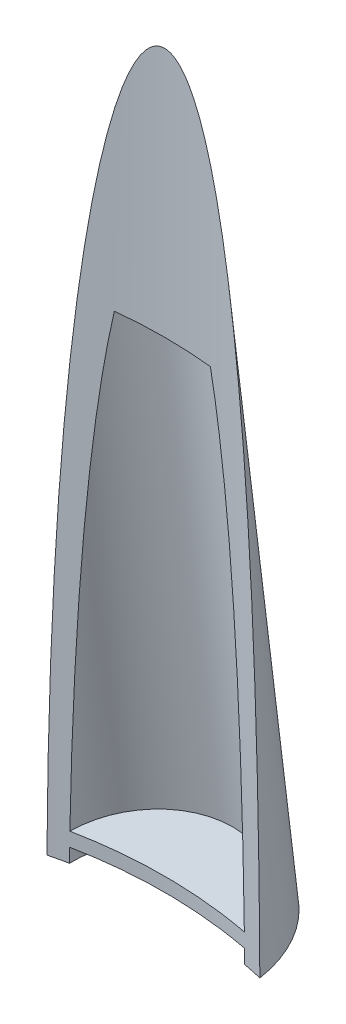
ISO-10303-21;
HEADER;
FILE_DESCRIPTION(('STEP AP214'),'2;1');
FILE_NAME('part.step','',(''),(''),'','','');
FILE_SCHEMA(('AUTOMOTIVE_DESIGN { 1 0 10303 214 1 1 1 1 }'));
ENDSEC;
DATA;
#1=APPLICATION_CONTEXT('core data for automotive mechanical design processes');
#2=APPLICATION_PROTOCOL_DEFINITION('international standard','automotive_design',2000,#1);
#3=PRODUCT_CONTEXT('',#1,'mechanical');
#4=PRODUCT('Part','Part','',(#3));
#5=PRODUCT_RELATED_PRODUCT_CATEGORY('part','',(#4));
#6=PRODUCT_DEFINITION_FORMATION('','',#4);
#7=PRODUCT_DEFINITION_CONTEXT('part definition',#1,'design');
#8=PRODUCT_DEFINITION('design','',#6,#7);
#9=PRODUCT_DEFINITION_SHAPE('','',#8);
#10=(LENGTH_UNIT() NAMED_UNIT(*) SI_UNIT(.MILLI.,.METRE.));
#11=(NAMED_UNIT(*) PLANE_ANGLE_UNIT() SI_UNIT($,.RADIAN.));
#12=(NAMED_UNIT(*) SI_UNIT($,.STERADIAN.) SOLID_ANGLE_UNIT());
#13=UNCERTAINTY_MEASURE_WITH_UNIT(LENGTH_MEASURE(1.E-05),#10,'distance_accuracy_value','');
#14=(GEOMETRIC_REPRESENTATION_CONTEXT(3) GLOBAL_UNCERTAINTY_ASSIGNED_CONTEXT((#13)) GLOBAL_UNIT_ASSIGNED_CONTEXT((#10,
#11,#12)) REPRESENTATION_CONTEXT('',''));
#15=CARTESIAN_POINT('',(0.,0.,0.));
#16=DIRECTION('',(0.,0.,1.));
#17=DIRECTION('',(1.,0.,0.));
#18=AXIS2_PLACEMENT_3D('',#15,#16,#17);
#19=CARTESIAN_POINT('',(0.,-8.82373528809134,24.3165815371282));
#20=DIRECTION('',(0.,-0.992546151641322,-0.121869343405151));
#21=DIRECTION('',(1.,0.,0.));
#22=AXIS2_PLACEMENT_3D('',#19,#20,#21);
#23=CYLINDRICAL_SURFACE('',#22,12.065);
#24=CARTESIAN_POINT('',(0.,-8.82373528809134,24.3165815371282));
#25=DIRECTION('',(0.,-0.992546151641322,-0.121869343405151));
#26=DIRECTION('',(1.,0.,0.));
#27=AXIS2_PLACEMENT_3D('',#24,#25,#26);
#28=CIRCLE('',#27,12.065);
#29=CARTESIAN_POINT('',(-6.58255705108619,-7.59150322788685,14.2808567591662));
#30=VERTEX_POINT('',#29);
#31=CARTESIAN_POINT('',(6.58255705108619,-7.59150322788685,14.2808567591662));
#32=VERTEX_POINT('',#31);
#33=EDGE_CURVE('E92',#30,#32,#28,.T.);
#34=ORIENTED_EDGE('',*,*,#33,.F.);
#35=CARTESIAN_POINT('',(-6.58255705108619,-7.59150322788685,14.2808567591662));
#36=CARTESIAN_POINT('',(-6.6904230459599,-8.08472638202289,14.291070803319));
#37=CARTESIAN_POINT('',(-6.79457407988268,-8.57875136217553,14.3011795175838));
#38=CARTESIAN_POINT('',(-6.99621983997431,-9.56814261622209,14.321181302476));
#39=CARTESIAN_POINT('',(-7.09371484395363,-10.0635088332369,14.3310743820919));
#40=CARTESIAN_POINT('',(-7.28281468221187,-11.0552756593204,14.3506390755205));
#41=CARTESIAN_POINT('',(-7.37442053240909,-11.5516760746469,14.3603107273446));
#42=CARTESIAN_POINT('',(-7.55234989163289,-12.5454304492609,14.3794318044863));
#43=CARTESIAN_POINT('',(-7.6386733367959,-13.0427844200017,14.3888812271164));
#44=CARTESIAN_POINT('',(-7.89040001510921,-14.5354978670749,14.4168827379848));
#45=CARTESIAN_POINT('',(-8.04866552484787,-15.5320711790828,14.4350991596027));
#46=CARTESIAN_POINT('',(-8.34927250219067,-17.5276628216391,14.4706309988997));
#47=CARTESIAN_POINT('',(-8.49161312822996,-18.5266812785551,14.4879463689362));
#48=CARTESIAN_POINT('',(-8.7624670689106,-20.5254423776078,14.5216575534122));
#49=CARTESIAN_POINT('',(-8.89099592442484,-21.5251829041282,14.5380543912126));
#50=CARTESIAN_POINT('',(-9.13613743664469,-23.5261116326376,14.5699548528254));
#51=CARTESIAN_POINT('',(-9.25275032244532,-24.5272998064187,14.5854584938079));
#52=CARTESIAN_POINT('',(-9.47543615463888,-26.5310395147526,14.6155837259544));
#53=CARTESIAN_POINT('',(-9.58150720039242,-27.5335912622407,14.6302051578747));
#54=CARTESIAN_POINT('',(-9.78416755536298,-29.5396681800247,14.6585727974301));
#55=CARTESIAN_POINT('',(-9.88075679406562,-30.5431933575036,14.672318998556));
#56=CARTESIAN_POINT('',(-10.1178656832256,-33.122266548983,14.7065224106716));
#57=CARTESIAN_POINT('',(-10.2521108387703,-34.6984012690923,14.7263478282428));
#58=CARTESIAN_POINT('',(-10.502172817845,-37.8521551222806,14.7639156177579));
#59=CARTESIAN_POINT('',(-10.6179894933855,-39.4297742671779,14.7816579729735));
#60=CARTESIAN_POINT('',(-10.83323550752,-42.5860912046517,14.8151062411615));
#61=CARTESIAN_POINT('',(-10.9326654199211,-44.1647889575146,14.8308122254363));
#62=CARTESIAN_POINT('',(-11.1167520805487,-47.3230541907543,14.8602363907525));
#63=CARTESIAN_POINT('',(-11.2014088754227,-48.902621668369,14.8739545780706));
#64=CARTESIAN_POINT('',(-11.3572650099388,-52.0631427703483,14.8994568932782));
#65=CARTESIAN_POINT('',(-11.4284582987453,-53.6440966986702,14.9112401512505));
#66=CARTESIAN_POINT('',(-11.5583751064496,-56.8065300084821,14.9329127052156));
#67=CARTESIAN_POINT('',(-11.6170986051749,-58.3880093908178,14.9428019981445));
#68=CARTESIAN_POINT('',(-11.7229155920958,-61.5513365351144,14.9607331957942));
#69=CARTESIAN_POINT('',(-11.7700092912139,-63.1331842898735,14.9687751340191));
#70=CARTESIAN_POINT('',(-11.8532549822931,-66.2971747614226,14.9830576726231));
#71=CARTESIAN_POINT('',(-11.8894069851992,-67.879317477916,14.989298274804));
#72=CARTESIAN_POINT('',(-11.9275265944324,-69.8274527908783,14.9959005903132));
#73=CARTESIAN_POINT('',(-11.9344084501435,-70.1933504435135,14.9970936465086));
#74=CARTESIAN_POINT('',(-11.9476218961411,-70.9251190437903,14.999386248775));
#75=CARTESIAN_POINT('',(-11.9539535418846,-71.2909899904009,15.0004858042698));
#76=CARTESIAN_POINT('',(-11.9600132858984,-71.6568657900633,15.0015389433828));
#77=B_SPLINE_CURVE_WITH_KNOTS('',3,(#35,#36,#37,#38,#39,#40,#41,#42,#43,#44,#45,#46,#47,#48,#49,
#50,#51,#52,#53,#54,#55,#56,#57,#58,#59,#60,#61,#62,#63,#64,#65,#66,#67,#68,#69,#70,#71,#72,#73,
#74,#75,#76),.UNSPECIFIED.,.F.,.F.,(4,2,2,2,2,2,2,2,2,2,2,2,2,2,2,2,2,2,2,2,4),(0.,
1.51491834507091,3.02977342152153,4.54436647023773,6.05897782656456,9.08648394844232,
12.1141499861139,15.1383728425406,18.162537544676,21.1872465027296,24.2119779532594,
28.9577390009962,33.7035381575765,38.4491710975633,43.1947890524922,47.9425347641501,
52.6902881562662,57.4379554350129,62.1856179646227,63.2835106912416,64.3812926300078),.UNSPECIFIED.);
#78=CARTESIAN_POINT('',(-11.9600132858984,-71.6568657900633,15.0015389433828));
#79=VERTEX_POINT('',#78);
#80=EDGE_CURVE('E83',#30,#79,#77,.T.);
#81=ORIENTED_EDGE('',*,*,#80,.T.);
#82=CARTESIAN_POINT('',(0.,-71.8504159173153,16.5778782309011));
#83=DIRECTION('',(0.,-0.992546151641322,-0.121869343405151));
#84=DIRECTION('',(1.,0.,0.));
#85=AXIS2_PLACEMENT_3D('',#82,#83,#84);
#86=CIRCLE('',#85,12.065);
#87=CARTESIAN_POINT('',(11.9600132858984,-71.6568657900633,15.0015389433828));
#88=VERTEX_POINT('',#87);
#89=EDGE_CURVE('E90',#79,#88,#86,.T.);
#90=ORIENTED_EDGE('',*,*,#89,.T.);
#91=CARTESIAN_POINT('',(11.9600132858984,-71.6568657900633,15.0015389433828));
#92=CARTESIAN_POINT('',(11.9433466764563,-70.6507158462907,14.9986428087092));
#93=CARTESIAN_POINT('',(11.9246292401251,-69.6446016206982,14.9953957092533));
#94=CARTESIAN_POINT('',(11.8829554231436,-67.6324623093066,14.988188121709));
#95=CARTESIAN_POINT('',(11.8599990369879,-66.6264372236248,14.984227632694));
#96=CARTESIAN_POINT('',(11.7845712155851,-63.6087512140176,14.9712598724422));
#97=CARTESIAN_POINT('',(11.7255374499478,-61.5972544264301,14.9611656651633));
#98=CARTESIAN_POINT('',(11.5886656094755,-57.5772893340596,14.9379982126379));
#99=CARTESIAN_POINT('',(11.510849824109,-55.5688202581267,14.9249284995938));
#100=CARTESIAN_POINT('',(11.3786290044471,-52.5567038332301,14.9030117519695));
#101=CARTESIAN_POINT('',(11.3319693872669,-51.5527047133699,14.8953202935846));
#102=CARTESIAN_POINT('',(11.2332017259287,-49.5449741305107,14.8791544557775));
#103=CARTESIAN_POINT('',(11.1810936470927,-48.5412426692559,14.8706800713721));
#104=CARTESIAN_POINT('',(11.0344729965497,-45.865212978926,14.8470229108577));
#105=CARTESIAN_POINT('',(10.9348454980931,-44.1931973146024,14.8311335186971));
#106=CARTESIAN_POINT('',(10.7178543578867,-40.8503481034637,14.7970894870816));
#107=CARTESIAN_POINT('',(10.6004908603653,-39.1795145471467,14.7789348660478));
#108=CARTESIAN_POINT('',(10.3457902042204,-35.8398282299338,14.7403088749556));
#109=CARTESIAN_POINT('',(10.2084582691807,-34.1709750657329,14.7198381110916));
#110=CARTESIAN_POINT('',(9.91082543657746,-30.8352478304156,14.6765203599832));
#111=CARTESIAN_POINT('',(9.7505235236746,-29.1683738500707,14.6536732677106));
#112=CARTESIAN_POINT('',(9.48958993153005,-26.6684658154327,14.617559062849));
#113=CARTESIAN_POINT('',(9.39909289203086,-25.8343555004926,14.6051997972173));
#114=CARTESIAN_POINT('',(9.21062329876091,-24.1669882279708,14.5798672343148));
#115=CARTESIAN_POINT('',(9.11265076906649,-23.3337312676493,14.5668939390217));
#116=CARTESIAN_POINT('',(8.9084496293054,-21.6683405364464,14.5403303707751));
#117=CARTESIAN_POINT('',(8.80222203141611,-20.836206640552,14.5267401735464));
#118=CARTESIAN_POINT('',(8.58052059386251,-19.1731665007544,14.4989378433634));
#119=CARTESIAN_POINT('',(8.46504663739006,-18.3422602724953,14.4847257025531));
#120=CARTESIAN_POINT('',(8.22351900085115,-16.6811871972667,14.4556644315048));
#121=CARTESIAN_POINT('',(8.09745537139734,-15.8510218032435,14.4408147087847));
#122=CARTESIAN_POINT('',(7.83329389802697,-14.1926356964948,14.4104925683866));
#123=CARTESIAN_POINT('',(7.69519649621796,-13.3644149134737,14.3950201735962));
#124=CARTESIAN_POINT('',(7.47744619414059,-12.123780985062,14.3713455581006));
#125=CARTESIAN_POINT('',(7.40307869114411,-11.7104327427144,14.3633746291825));
#126=CARTESIAN_POINT('',(7.25048530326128,-10.8844536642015,14.347279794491));
#127=CARTESIAN_POINT('',(7.17225944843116,-10.4718228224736,14.3391558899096));
#128=CARTESIAN_POINT('',(7.01156920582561,-9.64733626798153,14.3227558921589));
#129=CARTESIAN_POINT('',(6.92910430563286,-9.2354806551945,14.3144797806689));
#130=CARTESIAN_POINT('',(6.75947339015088,-8.41273104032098,14.2977789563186));
#131=CARTESIAN_POINT('',(6.67230724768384,-8.00183706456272,14.2893542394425));
#132=CARTESIAN_POINT('',(6.58255705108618,-7.59150322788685,14.2808567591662));
#133=B_SPLINE_CURVE_WITH_KNOTS('',3,(#91,#92,#93,#94,#95,#96,#97,#98,#99,#100,#101,#102,#103,
#104,#105,#106,#107,#108,#109,#110,#111,#112,#113,#114,#115,#116,#117,#118,#119,#120,#121,#122,
#123,#124,#125,#126,#127,#128,#129,#130,#131,#132),.UNSPECIFIED.,.F.,.F.,(4,2,2,2,2,2,2,2,2,2,2,
2,2,2,2,2,2,2,2,2,4),(0.,3.01887246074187,6.03774884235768,12.0748262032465,18.104774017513,
21.1200974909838,24.1354401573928,29.1605198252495,34.1855586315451,39.2092852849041,
44.2332340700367,46.7504953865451,49.2677485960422,51.7846936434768,54.3016704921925,
56.8210391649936,59.3403153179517,60.6004818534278,61.8606385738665,63.1209479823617,
64.3812915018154),.UNSPECIFIED.);
#134=EDGE_CURVE('E61',#88,#32,#133,.T.);
#135=ORIENTED_EDGE('',*,*,#134,.T.);
#136=EDGE_LOOP('',(#34,#81,#90,#135));
#137=FACE_BOUND('',#136,.T.);
#138=ADVANCED_FACE('F37',(#137),#23,.F.);
#139=CARTESIAN_POINT('',(0.,-8.82373528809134,24.3165815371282));
#140=DIRECTION('',(0.,-0.992546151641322,-0.121869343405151));
#141=DIRECTION('',(1.,0.,0.));
#142=AXIS2_PLACEMENT_3D('',#139,#140,#141);
#143=PLANE('',#142);
#144=CARTESIAN_POINT('',(0.,-16.1298363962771,83.82));
#145=DIRECTION('',(0.,-0.992546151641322,-0.121869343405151));
#146=DIRECTION('',(0.,-0.121869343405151,0.992546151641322));
#147=AXIS2_PLACEMENT_3D('',#144,#145,#146);
#148=ELLIPSE('',#147,70.3745613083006,69.85);
#149=EDGE_CURVE('E93',#30,#32,#148,.T.);
#150=ORIENTED_EDGE('',*,*,#149,.F.);
#151=ORIENTED_EDGE('',*,*,#33,.T.);
#152=EDGE_LOOP('',(#150,#151));
#153=FACE_BOUND('',#152,.T.);
#154=ADVANCED_FACE('F160',(#153),#143,.T.);
#155=CARTESIAN_POINT('',(0.,-71.8504159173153,16.5778782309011));
#156=DIRECTION('',(0.,-0.992546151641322,-0.121869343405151));
#157=DIRECTION('',(1.,0.,0.));
#158=AXIS2_PLACEMENT_3D('',#155,#156,#157);
#159=PLANE('',#158);
#160=ORIENTED_EDGE('',*,*,#89,.F.);
#161=CARTESIAN_POINT('',(0.,-80.106710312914,83.82));
#162=DIRECTION('',(0.,-0.992546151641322,-0.121869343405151));
#163=DIRECTION('',(0.,-0.121869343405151,0.992546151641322));
#164=AXIS2_PLACEMENT_3D('',#161,#162,#163);
#165=ELLIPSE('',#164,70.3745613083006,69.85);
#166=EDGE_CURVE('E11',#79,#88,#165,.T.);
#167=ORIENTED_EDGE('',*,*,#166,.T.);
#168=EDGE_LOOP('',(#160,#167));
#169=FACE_BOUND('',#168,.T.);
#170=ADVANCED_FACE('F95',(#169),#159,.F.);
#171=CARTESIAN_POINT('',(0.,26.9905740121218,83.82));
#172=DIRECTION('',(0.,-1.,0.));
#173=DIRECTION('',(0.,0.,-1.));
#174=AXIS2_PLACEMENT_3D('',#171,#172,#173);
#175=CYLINDRICAL_SURFACE('',#174,69.85);
#176=ORIENTED_EDGE('',*,*,#149,.T.);
#177=ORIENTED_EDGE('',*,*,#134,.F.);
#178=ORIENTED_EDGE('',*,*,#166,.F.);
#179=ORIENTED_EDGE('',*,*,#80,.F.);
#180=EDGE_LOOP('',(#176,#177,#178,#179));
#181=FACE_BOUND('',#180,.T.);
#182=CARTESIAN_POINT('',(0.,-83.9453227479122,83.82));
#183=DIRECTION('',(0.,-0.992546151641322,-0.121869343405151));
#184=DIRECTION('',(0.,-0.121869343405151,0.992546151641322));
#185=AXIS2_PLACEMENT_3D('',#182,#183,#184);
#186=ELLIPSE('',#185,70.3745613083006,69.85);
#187=CARTESIAN_POINT('',(-14.5923880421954,-75.5580634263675,15.5112545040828));
#188=VERTEX_POINT('',#187);
#189=CARTESIAN_POINT('',(-12.0137438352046,-75.4966274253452,15.0108984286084));
#190=VERTEX_POINT('',#189);
#191=EDGE_CURVE('E112',#188,#190,#186,.T.);
#192=ORIENTED_EDGE('',*,*,#191,.T.);
#193=CARTESIAN_POINT('',(-11.9893313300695,-73.5767984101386,15.0066405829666));
#194=CARTESIAN_POINT('',(-11.9938052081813,-73.8967646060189,15.007420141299));
#195=CARTESIAN_POINT('',(-11.9980765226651,-74.2167334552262,15.0081647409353));
#196=CARTESIAN_POINT('',(-12.0062140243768,-74.8566764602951,15.0095840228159));
#197=CARTESIAN_POINT('',(-12.0100802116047,-75.1766506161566,15.0102587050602));
#198=CARTESIAN_POINT('',(-12.0137438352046,-75.4966274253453,15.0108984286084));
#199=B_SPLINE_CURVE_WITH_KNOTS('',3,(#193,#194,#195,#196,#197,#198),.UNSPECIFIED.,.F.,.F.,(4,2,
4),(0.,0.959994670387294,1.91998934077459),.UNSPECIFIED.);
#200=CARTESIAN_POINT('',(-11.9893313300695,-73.5767984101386,15.0066405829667));
#201=VERTEX_POINT('',#200);
#202=EDGE_CURVE('E53',#201,#190,#199,.T.);
#203=ORIENTED_EDGE('',*,*,#202,.F.);
#204=CARTESIAN_POINT('',(0.,-82.0260165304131,83.82));
#205=DIRECTION('',(0.,-0.992546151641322,-0.121869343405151));
#206=DIRECTION('',(0.,-0.121869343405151,0.992546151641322));
#207=AXIS2_PLACEMENT_3D('',#204,#205,#206);
#208=ELLIPSE('',#207,70.3745613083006,69.85);
#209=CARTESIAN_POINT('',(11.9893313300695,-73.5767984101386,15.0066405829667));
#210=VERTEX_POINT('',#209);
#211=EDGE_CURVE('E221',#201,#210,#208,.T.);
#212=ORIENTED_EDGE('',*,*,#211,.T.);
#213=CARTESIAN_POINT('',(12.0137438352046,-75.4966274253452,15.0108984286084));
#214=CARTESIAN_POINT('',(12.0100802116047,-75.1766506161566,15.0102587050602));
#215=CARTESIAN_POINT('',(12.0062140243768,-74.8566764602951,15.0095840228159));
#216=CARTESIAN_POINT('',(11.9980765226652,-74.2167334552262,15.0081647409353));
#217=CARTESIAN_POINT('',(11.9938052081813,-73.8967646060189,15.007420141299));
#218=CARTESIAN_POINT('',(11.9893313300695,-73.5767984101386,15.0066405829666));
#219=B_SPLINE_CURVE_WITH_KNOTS('',3,(#213,#214,#215,#216,#217,#218),.UNSPECIFIED.,.F.,.F.,(4,2,
4),(0.,0.959994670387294,1.91998934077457),.UNSPECIFIED.);
#220=CARTESIAN_POINT('',(12.0137438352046,-75.4966274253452,15.0108984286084));
#221=VERTEX_POINT('',#220);
#222=EDGE_CURVE('E145',#221,#210,#219,.T.);
#223=ORIENTED_EDGE('',*,*,#222,.F.);
#224=CARTESIAN_POINT('',(14.5923880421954,-75.5580634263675,15.5112545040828));
#225=VERTEX_POINT('',#224);
#226=EDGE_CURVE('E110',#221,#225,#186,.T.);
#227=ORIENTED_EDGE('',*,*,#226,.T.);
#228=CARTESIAN_POINT('',(-14.5923880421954,-75.5580634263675,15.5112545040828));
#229=CARTESIAN_POINT('',(-14.5861693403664,-74.3422467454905,15.5099264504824));
#230=CARTESIAN_POINT('',(-14.5776339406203,-73.1264435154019,15.5081034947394));
#231=CARTESIAN_POINT('',(-14.5558014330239,-70.6948803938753,15.5034479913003));
#232=CARTESIAN_POINT('',(-14.5425043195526,-69.4791205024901,15.5006154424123));
#233=CARTESIAN_POINT('',(-14.4952760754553,-65.831788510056,15.4905733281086));
#234=CARTESIAN_POINT('',(-14.4540087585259,-63.4003103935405,15.4818194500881));
#235=CARTESIAN_POINT('',(-14.3504748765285,-58.5320364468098,15.4600030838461));
#236=CARTESIAN_POINT('',(-14.2881586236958,-56.0952417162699,15.446930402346));
#237=CARTESIAN_POINT('',(-14.1408380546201,-51.2224761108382,15.4163093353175));
#238=CARTESIAN_POINT('',(-14.0558348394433,-48.7865052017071,15.3987611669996));
#239=CARTESIAN_POINT('',(-13.8736356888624,-44.2334382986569,15.3616024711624));
#240=CARTESIAN_POINT('',(-13.7794787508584,-42.1162163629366,15.3425599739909));
#241=CARTESIAN_POINT('',(-13.5704642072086,-37.8828077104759,15.3008319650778));
#242=CARTESIAN_POINT('',(-13.4556064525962,-35.766621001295,15.2781464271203));
#243=CARTESIAN_POINT('',(-13.2027989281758,-31.5350901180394,15.2290003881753));
#244=CARTESIAN_POINT('',(-13.0648429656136,-29.4197463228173,15.2025388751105));
#245=CARTESIAN_POINT('',(-12.7628062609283,-25.1909951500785,15.1457187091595));
#246=CARTESIAN_POINT('',(-12.5987258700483,-23.0775877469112,15.1153601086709));
#247=CARTESIAN_POINT('',(-12.2406122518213,-18.8555549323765,15.0506522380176));
#248=CARTESIAN_POINT('',(-12.0466104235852,-16.7469268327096,15.0163071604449));
#249=CARTESIAN_POINT('',(-11.7288783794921,-13.5866683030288,14.961686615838));
#250=CARTESIAN_POINT('',(-11.6185086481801,-12.53366065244,14.9429619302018));
#251=CARTESIAN_POINT('',(-11.3879400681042,-10.4287385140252,14.9044645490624));
#252=CARTESIAN_POINT('',(-11.2677412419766,-9.37682402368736,14.8846918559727));
#253=CARTESIAN_POINT('',(-11.0165015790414,-7.27482605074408,14.844095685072));
#254=CARTESIAN_POINT('',(-10.8854660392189,-6.22474192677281,14.8232727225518));
#255=CARTESIAN_POINT('',(-10.6111758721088,-4.1261939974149,14.7805567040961));
#256=CARTESIAN_POINT('',(-10.4679213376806,-3.07773017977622,14.7586636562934));
#257=CARTESIAN_POINT('',(-10.1675464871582,-0.982923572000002,14.7138022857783));
#258=CARTESIAN_POINT('',(-10.0104276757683,0.0634194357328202,14.6908340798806));
#259=CARTESIAN_POINT('',(-9.68019654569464,2.15354129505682,14.643817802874));
#260=CARTESIAN_POINT('',(-9.50708473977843,3.19732022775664,14.6197697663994));
#261=CARTESIAN_POINT('',(-9.23321310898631,4.76096487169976,14.5828804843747));
#262=CARTESIAN_POINT('',(-9.13950917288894,5.28208013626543,14.5704419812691));
#263=CARTESIAN_POINT('',(-8.94692931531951,6.32335003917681,14.5452975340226));
#264=CARTESIAN_POINT('',(-8.84805339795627,6.84350467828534,14.5325915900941));
#265=CARTESIAN_POINT('',(-8.64459431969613,7.88276873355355,14.5069131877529));
#266=CARTESIAN_POINT('',(-8.54001034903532,8.40187799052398,14.4939406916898));
#267=CARTESIAN_POINT('',(-8.32452036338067,9.4387778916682,14.4677351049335));
#268=CARTESIAN_POINT('',(-8.21361436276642,9.9565685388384,14.454502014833));
#269=CARTESIAN_POINT('',(-7.98478924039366,10.9902678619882,14.4277892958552));
#270=CARTESIAN_POINT('',(-7.86687438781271,11.5061774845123,14.4143098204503));
#271=CARTESIAN_POINT('',(-7.62303783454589,12.5360930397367,14.3871054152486));
#272=CARTESIAN_POINT('',(-7.4971162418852,13.0500989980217,14.3733804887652));
#273=CARTESIAN_POINT('',(-7.2361210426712,14.0756599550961,14.3457005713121));
#274=CARTESIAN_POINT('',(-7.10104952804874,14.5872154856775,14.3317456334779));
#275=CARTESIAN_POINT('',(-6.82022943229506,15.6073674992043,14.3036213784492));
#276=CARTESIAN_POINT('',(-6.67448136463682,16.1159641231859,14.2894520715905));
#277=CARTESIAN_POINT('',(-6.3700914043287,17.1301286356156,14.2609037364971));
#278=CARTESIAN_POINT('',(-6.2114306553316,17.6356908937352,14.2465244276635));
#279=CARTESIAN_POINT('',(-5.87863893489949,18.6418521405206,14.2176148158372));
#280=CARTESIAN_POINT('',(-5.7045043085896,19.1424499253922,14.2030844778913));
#281=CARTESIAN_POINT('',(-5.33668445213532,20.1373284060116,14.1739191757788));
#282=CARTESIAN_POINT('',(-5.14297197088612,20.631599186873,14.1592840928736));
#283=CARTESIAN_POINT('',(-4.83351934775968,21.3649135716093,14.1373610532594));
#284=CARTESIAN_POINT('',(-4.72724473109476,21.6079543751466,14.1300597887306));
#285=CARTESIAN_POINT('',(-4.50731993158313,22.0906658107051,14.1154897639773));
#286=CARTESIAN_POINT('',(-4.39367051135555,22.3303367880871,14.1082210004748));
#287=CARTESIAN_POINT('',(-4.15698584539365,22.8067359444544,14.0937057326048));
#288=CARTESIAN_POINT('',(-4.03390061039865,23.0434394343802,14.0864595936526));
#289=CARTESIAN_POINT('',(-3.77706194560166,23.5111708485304,14.0720761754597));
#290=CARTESIAN_POINT('',(-3.64330403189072,23.7421963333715,14.0649389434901));
#291=CARTESIAN_POINT('',(-3.36333700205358,24.1952812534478,14.050880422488));
#292=CARTESIAN_POINT('',(-3.21718374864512,24.4173748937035,14.0439583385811));
#293=CARTESIAN_POINT('',(-2.90876124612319,24.8499733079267,14.0304198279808));
#294=CARTESIAN_POINT('',(-2.74650930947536,25.0604901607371,14.0238030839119));
#295=CARTESIAN_POINT('',(-2.44929044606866,25.4078394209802,14.0128444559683));
#296=CARTESIAN_POINT('',(-2.31928754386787,25.5488797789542,14.0083817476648));
#297=CARTESIAN_POINT('',(-2.04602723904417,25.818224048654,13.9998381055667));
#298=CARTESIAN_POINT('',(-1.90274807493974,25.9465063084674,13.9957578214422));
#299=CARTESIAN_POINT('',(-1.59905285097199,26.1855531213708,13.9881381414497));
#300=CARTESIAN_POINT('',(-1.43844859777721,26.2960841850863,13.9846059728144));
#301=CARTESIAN_POINT('',(-1.10056936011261,26.487816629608,13.978468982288));
#302=CARTESIAN_POINT('',(-0.923357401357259,26.5691236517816,13.975860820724));
#303=CARTESIAN_POINT('',(-0.614700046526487,26.6708900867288,13.9725936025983));
#304=CARTESIAN_POINT('',(-0.486975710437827,26.7025224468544,13.9715770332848));
#305=CARTESIAN_POINT('',(-0.228019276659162,26.7437243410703,13.9702526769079));
#306=CARTESIAN_POINT('',(-0.0967908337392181,26.7533160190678,13.9699441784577));
#307=CARTESIAN_POINT('',(0.165435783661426,26.7493194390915,13.9700726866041));
#308=CARTESIAN_POINT('',(0.296433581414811,26.7357072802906,13.9705104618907));
#309=CARTESIAN_POINT('',(0.55433945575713,26.6868651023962,13.9720801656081));
#310=CARTESIAN_POINT('',(0.681242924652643,26.651611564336,13.973212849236));
#311=CARTESIAN_POINT('',(0.972835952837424,26.5469286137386,13.976572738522));
#312=CARTESIAN_POINT('',(1.13471251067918,26.4697698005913,13.9790470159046));
#313=CARTESIAN_POINT('',(1.44440761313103,26.2911748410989,13.9847626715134));
#314=CARTESIAN_POINT('',(1.59218999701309,26.1896784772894,13.9880059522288));
#315=CARTESIAN_POINT('',(1.86071029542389,25.9805963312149,13.994671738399));
#316=CARTESIAN_POINT('',(1.98268091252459,25.8745581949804,13.9980462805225));
#317=CARTESIAN_POINT('',(2.21718451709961,25.6524360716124,14.0050992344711));
#318=CARTESIAN_POINT('',(2.32970895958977,25.5363431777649,14.0087779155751));
#319=CARTESIAN_POINT('',(2.54679097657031,25.2964979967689,14.0163598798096));
#320=CARTESIAN_POINT('',(2.65132854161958,25.172727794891,14.020263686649));
#321=CARTESIAN_POINT('',(2.85326112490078,24.919621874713,14.0282269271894));
#322=CARTESIAN_POINT('',(2.95065893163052,24.7902883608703,14.0322862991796));
#323=CARTESIAN_POINT('',(3.19913824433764,24.4439765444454,14.0431278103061));
#324=CARTESIAN_POINT('',(3.34514966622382,24.2233696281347,14.0500060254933));
#325=CARTESIAN_POINT('',(3.62431046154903,23.7741122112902,14.0639511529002));
#326=CARTESIAN_POINT('',(3.75745220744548,23.5454570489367,14.0710181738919));
#327=CARTESIAN_POINT('',(4.01344006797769,23.081918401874,14.0852794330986));
#328=CARTESIAN_POINT('',(4.13626591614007,22.8470237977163,14.0924738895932));
#329=CARTESIAN_POINT('',(4.37314062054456,22.3728454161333,14.106929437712));
#330=CARTESIAN_POINT('',(4.48718841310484,22.1335611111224,14.1141905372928));
#331=CARTESIAN_POINT('',(4.70844638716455,21.6502984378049,14.1287854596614));
#332=CARTESIAN_POINT('',(4.81561617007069,21.4063016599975,14.1361194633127));
#333=CARTESIAN_POINT('',(5.02350930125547,20.9155749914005,14.1507980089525));
#334=CARTESIAN_POINT('',(5.12423235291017,20.6688449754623,14.1581425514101));
#335=CARTESIAN_POINT('',(5.31993704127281,20.1735077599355,14.1728149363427));
#336=CARTESIAN_POINT('',(5.41492621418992,19.9249035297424,14.1801427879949));
#337=CARTESIAN_POINT('',(5.5999699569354,19.4258804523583,14.1947788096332));
#338=CARTESIAN_POINT('',(5.69002467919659,19.1754616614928,14.2020869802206));
#339=CARTESIAN_POINT('',(5.98215054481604,18.3404729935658,14.2263324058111));
#340=CARTESIAN_POINT('',(6.17463924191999,17.7525391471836,14.243205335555));
#341=CARTESIAN_POINT('',(6.54119865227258,16.570918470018,14.2767117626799));
#342=CARTESIAN_POINT('',(6.71526614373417,15.9772306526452,14.2933452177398));
#343=CARTESIAN_POINT('',(7.04845645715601,14.7853326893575,14.326332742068));
#344=CARTESIAN_POINT('',(7.20757097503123,14.1871202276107,14.3426866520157));
#345=CARTESIAN_POINT('',(7.51322932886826,12.9874796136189,14.3750759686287));
#346=CARTESIAN_POINT('',(7.65977271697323,12.3860513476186,14.3911113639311));
#347=CARTESIAN_POINT('',(7.94247195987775,11.1792097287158,14.4228825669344));
#348=CARTESIAN_POINT('',(8.07860157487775,10.573790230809,14.4386175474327));
#349=CARTESIAN_POINT('',(8.34150752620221,9.36091311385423,14.469734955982));
#350=CARTESIAN_POINT('',(8.46828373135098,8.75345546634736,14.4851173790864));
#351=CARTESIAN_POINT('',(8.71356822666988,7.53708028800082,14.5155160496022));
#352=CARTESIAN_POINT('',(8.83207927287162,6.9281633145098,14.5305324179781));
#353=CARTESIAN_POINT('',(9.06178114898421,5.70893849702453,14.5601992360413));
#354=CARTESIAN_POINT('',(9.17297188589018,5.09863063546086,14.574849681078));
#355=CARTESIAN_POINT('',(9.49669751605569,3.26602692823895,14.6182453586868));
#356=CARTESIAN_POINT('',(9.69940079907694,2.04197568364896,14.6464368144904));
#357=CARTESIAN_POINT('',(10.0831610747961,-0.409604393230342,14.7013354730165));
#358=CARTESIAN_POINT('',(10.2642164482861,-1.63713347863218,14.7280425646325));
#359=CARTESIAN_POINT('',(10.6076752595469,-4.09305061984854,14.7799403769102));
#360=CARTESIAN_POINT('',(10.7701046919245,-5.32143501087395,14.805133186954));
#361=CARTESIAN_POINT('',(11.0790614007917,-7.78019355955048,14.8540567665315));
#362=CARTESIAN_POINT('',(11.2255890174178,-9.01056767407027,14.8777875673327));
#363=CARTESIAN_POINT('',(11.5108901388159,-11.527958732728,14.9248352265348));
#364=CARTESIAN_POINT('',(11.6490242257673,-12.8150491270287,14.9480861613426));
#365=CARTESIAN_POINT('',(11.9117439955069,-15.390644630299,14.9930387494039));
#366=CARTESIAN_POINT('',(12.0363295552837,-16.6791497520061,15.0147403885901));
#367=CARTESIAN_POINT('',(12.2733388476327,-19.2573580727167,15.056622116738));
#368=CARTESIAN_POINT('',(12.3857620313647,-20.5470613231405,15.0768021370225));
#369=CARTESIAN_POINT('',(12.5995626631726,-23.1274019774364,15.1156676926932));
#370=CARTESIAN_POINT('',(12.700940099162,-24.4180393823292,15.1343532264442));
#371=CARTESIAN_POINT('',(12.9900670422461,-28.2926799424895,15.188233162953));
#372=CARTESIAN_POINT('',(13.1626702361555,-30.8778514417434,15.2212256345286));
#373=CARTESIAN_POINT('',(13.4733584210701,-36.0503322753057,15.2815730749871));
#374=CARTESIAN_POINT('',(13.611443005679,-38.637641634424,15.3089279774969));
#375=CARTESIAN_POINT('',(13.7957172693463,-42.5176929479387,15.3458842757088));
#376=CARTESIAN_POINT('',(13.8532973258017,-43.8098864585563,15.3575162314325));
#377=CARTESIAN_POINT('',(13.961303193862,-46.3945704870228,15.3794597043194));
#378=CARTESIAN_POINT('',(14.0117290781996,-47.6870610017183,15.3897712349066));
#379=CARTESIAN_POINT('',(14.1528481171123,-51.564940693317,15.4187667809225));
#380=CARTESIAN_POINT('',(14.2333817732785,-54.1507191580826,15.4355115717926));
#381=CARTESIAN_POINT('',(14.3697572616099,-59.3223960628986,15.4640392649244));
#382=CARTESIAN_POINT('',(14.4256042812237,-61.9082943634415,15.4758232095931));
#383=CARTESIAN_POINT('',(14.5144546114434,-67.0804821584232,15.494637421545));
#384=CARTESIAN_POINT('',(14.5474581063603,-69.6667716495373,15.5016677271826));
#385=CARTESIAN_POINT('',(14.5744730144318,-72.8039429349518,15.5074297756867));
#386=CARTESIAN_POINT('',(14.5787293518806,-73.354744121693,15.5083380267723));
#387=CARTESIAN_POINT('',(14.5862787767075,-74.4563836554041,15.5099495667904));
#388=CARTESIAN_POINT('',(14.589571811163,-75.0072220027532,15.5106528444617));
#389=CARTESIAN_POINT('',(14.5923880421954,-75.5580634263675,15.5112545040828));
#390=B_SPLINE_CURVE_WITH_KNOTS('',3,(#228,#229,#230,#231,#232,#233,#234,#235,#236,#237,#238,
#239,#240,#241,#242,#243,#244,#245,#246,#247,#248,#249,#250,#251,#252,#253,#254,#255,#256,#257,
#258,#259,#260,#261,#262,#263,#264,#265,#266,#267,#268,#269,#270,#271,#272,#273,#274,#275,#276,
#277,#278,#279,#280,#281,#282,#283,#284,#285,#286,#287,#288,#289,#290,#291,#292,#293,#294,#295,
#296,#297,#298,#299,#300,#301,#302,#303,#304,#305,#306,#307,#308,#309,#310,#311,#312,#313,#314,
#315,#316,#317,#318,#319,#320,#321,#322,#323,#324,#325,#326,#327,#328,#329,#330,#331,#332,#333,
#334,#335,#336,#337,#338,#339,#340,#341,#342,#343,#344,#345,#346,#347,#348,#349,#350,#351,#352,
#353,#354,#355,#356,#357,#358,#359,#360,#361,#362,#363,#364,#365,#366,#367,#368,#369,#370,#371,
#372,#373,#374,#375,#376,#377,#378,#379,#380,#381,#382,#383,#384,#385,#386,#387,#388,#389),
.UNSPECIFIED.,.F.,.F.,(4,2,2,2,2,2,2,2,2,2,2,2,2,2,2,2,2,2,2,2,2,2,2,2,2,2,2,2,2,2,2,2,2,2,2,2,
2,2,2,2,2,2,2,2,2,2,2,2,2,2,2,2,2,2,2,2,2,2,2,2,2,2,2,2,2,2,2,2,2,2,2,2,2,2,2,2,2,2,2,2,4),(0.,
3.64749520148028,7.29499470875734,14.5904326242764,21.9032138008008,29.215640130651,
35.573747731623,41.9319010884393,48.2917618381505,54.6515370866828,61.0046833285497,
64.1814703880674,67.3582501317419,70.5334861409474,73.7086980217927,76.8835657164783,
80.0583316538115,81.6471674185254,83.2360019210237,84.8250624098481,86.4141192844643,
88.0022179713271,89.5902952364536,91.1780106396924,92.7656497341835,94.3556503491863,
95.9460275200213,97.5386497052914,98.3346365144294,99.1305411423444,99.9310003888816,
100.731797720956,101.529160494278,102.325674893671,102.900634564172,103.476553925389,
104.059518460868,104.640353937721,105.033450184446,105.4261513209,105.819257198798,
106.212791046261,106.747771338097,107.28408922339,107.768342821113,108.253029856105,
108.738893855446,109.224567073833,110.017850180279,110.811600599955,111.606875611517,
112.402246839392,113.201927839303,114.001645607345,114.800288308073,115.598906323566,
117.455074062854,119.311565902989,121.169082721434,123.026665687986,124.888784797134,
126.750930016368,128.612451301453,130.47399623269,134.196855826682,137.919993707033,
141.637870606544,145.355667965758,149.239656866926,153.123681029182,157.007880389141,
160.892083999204,168.665190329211,176.438388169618,180.318954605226,184.199481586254,
191.960592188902,199.720071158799,207.479487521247,209.131942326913,210.784487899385),.UNSPECIFIED.);
#391=EDGE_CURVE('E115',#188,#225,#390,.T.);
#392=ORIENTED_EDGE('',*,*,#391,.F.);
#393=EDGE_LOOP('',(#192,#203,#212,#223,#227,#392));
#394=FACE_BOUND('',#393,.T.);
#395=ADVANCED_FACE('F82',(#181,#394),#175,.F.);
#396=CARTESIAN_POINT('',(0.,-75.6320167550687,16.1135560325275));
#397=DIRECTION('',(0.,0.992546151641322,0.121869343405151));
#398=DIRECTION('',(-1.,0.,0.));
#399=AXIS2_PLACEMENT_3D('',#396,#397,#398);
#400=CYLINDRICAL_SURFACE('',#399,14.605);
#401=CARTESIAN_POINT('',(0.,-75.6320167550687,16.1135560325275));
#402=DIRECTION('',(0.,-0.992546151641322,-0.121869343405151));
#403=DIRECTION('',(1.,0.,0.));
#404=AXIS2_PLACEMENT_3D('',#401,#402,#403);
#405=CIRCLE('',#404,14.605);
#406=EDGE_CURVE('E46',#188,#225,#405,.T.);
#407=ORIENTED_EDGE('',*,*,#406,.F.);
#408=ORIENTED_EDGE('',*,*,#391,.T.);
#409=EDGE_LOOP('',(#407,#408));
#410=FACE_BOUND('',#409,.T.);
#411=ADVANCED_FACE('F39',(#410),#400,.T.);
#412=CARTESIAN_POINT('',(0.,-75.6320167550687,16.1135560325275));
#413=DIRECTION('',(0.,-0.992546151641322,-0.121869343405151));
#414=DIRECTION('',(1.,0.,0.));
#415=AXIS2_PLACEMENT_3D('',#412,#413,#414);
#416=PLANE('',#415);
#417=ORIENTED_EDGE('',*,*,#191,.F.);
#418=ORIENTED_EDGE('',*,*,#406,.T.);
#419=ORIENTED_EDGE('',*,*,#226,.F.);
#420=CARTESIAN_POINT('',(0.,-75.6320167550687,16.1135560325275));
#421=DIRECTION('',(0.,-0.992546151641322,-0.121869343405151));
#422=DIRECTION('',(1.,0.,0.));
#423=AXIS2_PLACEMENT_3D('',#420,#421,#422);
#424=CIRCLE('',#423,12.065);
#425=EDGE_CURVE('E100',#190,#221,#424,.T.);
#426=ORIENTED_EDGE('',*,*,#425,.F.);
#427=EDGE_LOOP('',(#417,#418,#419,#426));
#428=FACE_BOUND('',#427,.T.);
#429=ADVANCED_FACE('F108',(#428),#416,.T.);
#430=CARTESIAN_POINT('',(0.,-73.741216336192,16.3457171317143));
#431=DIRECTION('',(0.,-0.992546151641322,-0.121869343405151));
#432=DIRECTION('',(1.,0.,0.));
#433=AXIS2_PLACEMENT_3D('',#430,#431,#432);
#434=CYLINDRICAL_SURFACE('',#433,12.065);
#435=CARTESIAN_POINT('',(0.,-73.741216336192,16.3457171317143));
#436=DIRECTION('',(0.,-0.992546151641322,-0.121869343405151));
#437=DIRECTION('',(1.,0.,0.));
#438=AXIS2_PLACEMENT_3D('',#435,#436,#437);
#439=CIRCLE('',#438,12.065);
#440=EDGE_CURVE('E96',#201,#210,#439,.T.);
#441=ORIENTED_EDGE('',*,*,#440,.F.);
#442=ORIENTED_EDGE('',*,*,#202,.T.);
#443=ORIENTED_EDGE('',*,*,#425,.T.);
#444=ORIENTED_EDGE('',*,*,#222,.T.);
#445=EDGE_LOOP('',(#441,#442,#443,#444));
#446=FACE_BOUND('',#445,.T.);
#447=ADVANCED_FACE('F155',(#446),#434,.F.);
#448=CARTESIAN_POINT('',(0.,-73.741216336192,16.3457171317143));
#449=DIRECTION('',(0.,-0.992546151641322,-0.121869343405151));
#450=DIRECTION('',(1.,0.,0.));
#451=AXIS2_PLACEMENT_3D('',#448,#449,#450);
#452=PLANE('',#451);
#453=ORIENTED_EDGE('',*,*,#211,.F.);
#454=ORIENTED_EDGE('',*,*,#440,.T.);
#455=EDGE_LOOP('',(#453,#454));
#456=FACE_BOUND('',#455,.T.);
#457=ADVANCED_FACE('F127',(#456),#452,.T.);
#458=CLOSED_SHELL('',(#138,#154,#170,#395,#411,#429,#447,#457));
#459=MANIFOLD_SOLID_BREP('B2',#458);
#460=ADVANCED_BREP_SHAPE_REPRESENTATION('',(#18,#459),#14);
#461=SHAPE_DEFINITION_REPRESENTATION(#9,#460);
ENDSEC;
END-ISO-10303-21;
